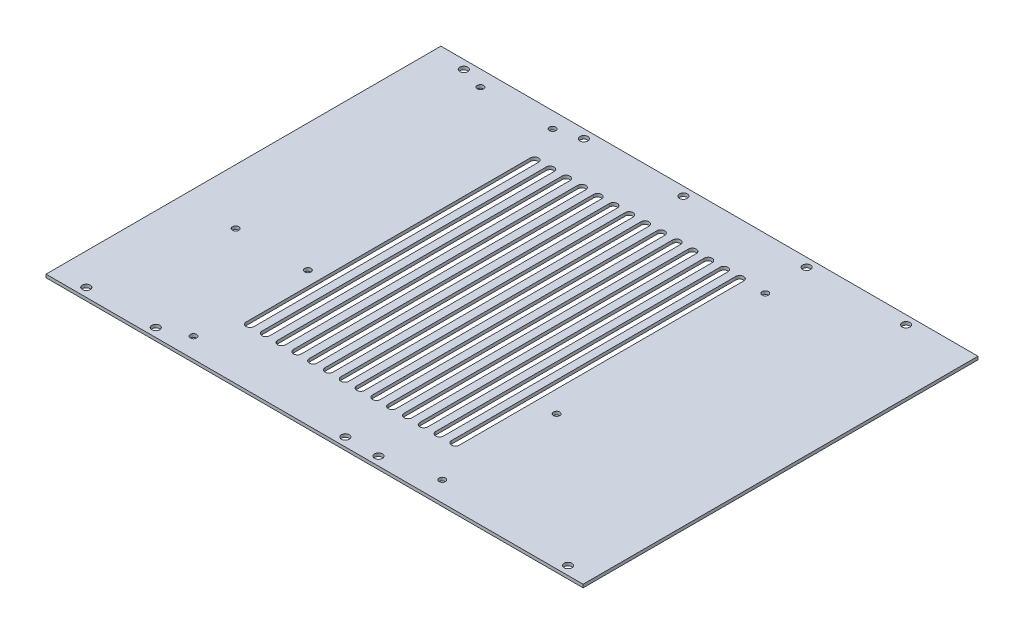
from build123d import *

# Parameters (mm, degrees)
SKETCH1_W           = 340
SKETCH1_H           = 250
SKETCH1_R           = 2
SKETCH1_R_2         = 2.5
BOSS_EXTRUDE1_DEPTH = 2


with BuildPart() as part:
    # Sketch1 → Boss-Extrude1 (new body)
    with BuildSketch(Plane(origin=(0, 0, 0), x_dir=(1, 0, 0), z_dir=(0, 1, 0))):
        Rectangle(SKETCH1_W, SKETCH1_H)
        with Locations(Location((-135, 115, 0), (0, 0, 270))):
            Circle(SKETCH1_R, mode=Mode.SUBTRACT)
        with Locations(Location((-89.28, 115, 0), (0, 0, 270))):
            Circle(SKETCH1_R, mode=Mode.SUBTRACT)
        with Locations(Location((68.2, 92.14, 0), (0, 0, 270))):
            Circle(SKETCH1_R, mode=Mode.SUBTRACT)
        with Locations(Location((-135, -39.94, 0), (0, 0, 270))):
            Circle(SKETCH1_R, mode=Mode.SUBTRACT)
        with Locations(Location((-89.28, -39.94, 0), (0, 0, 270))):
            Circle(SKETCH1_R, mode=Mode.SUBTRACT)
        with Locations(Location((68.2, -39.94, 0), (0, 0, 270))):
            Circle(SKETCH1_R, mode=Mode.SUBTRACT)
        with Locations(Location((-89.28, -112.33, 0), (0, 0, 270))):
            Circle(SKETCH1_R, mode=Mode.SUBTRACT)
        with Locations(Location((68.2, -112.33, 0), (0, 0, 270))):
            Circle(SKETCH1_R, mode=Mode.SUBTRACT)
        with Locations(Location((130, 119.5, 0), (0, 0, 270))):
            Circle(SKETCH1_R_2, mode=Mode.SUBTRACT)
        with Locations(Location((67, 119.5, 0), (0, 0, 270))):
            Circle(SKETCH1_R_2, mode=Mode.SUBTRACT)
        with Locations(Location((-11, 119.5, 0), (0, 0, 270))):
            Circle(SKETCH1_R_2, mode=Mode.SUBTRACT)
        with Locations(Location((-74, 119.5, 0), (0, 0, 270))):
            Circle(SKETCH1_R_2, mode=Mode.SUBTRACT)
        with Locations(Location((-106, -119.5, 0), (0, 0, 270))):
            Circle(SKETCH1_R_2, mode=Mode.SUBTRACT)
        with Locations(Location((14, -119.5, 0), (0, 0, 270))):
            Circle(SKETCH1_R_2, mode=Mode.SUBTRACT)
        with Locations(Location((35, -119.5, 0), (0, 0, 270))):
            Circle(SKETCH1_R_2, mode=Mode.SUBTRACT)
        with Locations(Location((155, -119.5, 0), (0, 0, 270))):
            Circle(SKETCH1_R_2, mode=Mode.SUBTRACT)
        with Locations(Location((-150, -119.5, 0), (0, 0, 270))):
            Circle(SKETCH1_R_2, mode=Mode.SUBTRACT)
        with Locations(Location((-150, 119.5, 0), (0, 0, 270))):
            Circle(SKETCH1_R_2, mode=Mode.SUBTRACT)
        with BuildLine():
            Line((-75.417136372, 92.093914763), (-75.417136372, -87.906085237))
            ThreePointArc((-75.417136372, -87.906085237), (-77.917136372, -90.406085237), (-80.417136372, -87.906085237))
            Line((-80.417136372, -87.906085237), (-80.417136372, 92.093914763))
            ThreePointArc((-80.417136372, 92.093914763), (-77.917136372, 94.593914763), (-75.417136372, 92.093914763))
        make_face(mode=Mode.SUBTRACT)
        with BuildLine():
            Line((-65.417136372, 92.093914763), (-65.417136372, -87.906085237))
            ThreePointArc((-65.417136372, -87.906085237), (-67.917136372, -90.406085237), (-70.417136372, -87.906085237))
            Line((-70.417136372, -87.906085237), (-70.417136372, 92.093914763))
            ThreePointArc((-70.417136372, 92.093914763), (-67.917136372, 94.593914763), (-65.417136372, 92.093914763))
        make_face(mode=Mode.SUBTRACT)
        with BuildLine():
            Line((-55.417136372, 92.093914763), (-55.417136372, -87.906085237))
            ThreePointArc((-55.417136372, -87.906085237), (-57.917136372, -90.406085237), (-60.417136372, -87.906085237))
            Line((-60.417136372, -87.906085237), (-60.417136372, 92.093914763))
            ThreePointArc((-60.417136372, 92.093914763), (-57.917136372, 94.593914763), (-55.417136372, 92.093914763))
        make_face(mode=Mode.SUBTRACT)
        with BuildLine():
            Line((-45.417136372, 92.093914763), (-45.417136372, -87.906085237))
            ThreePointArc((-45.417136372, -87.906085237), (-47.917136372, -90.406085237), (-50.417136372, -87.906085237))
            Line((-50.417136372, -87.906085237), (-50.417136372, 92.093914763))
            ThreePointArc((-50.417136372, 92.093914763), (-47.917136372, 94.593914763), (-45.417136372, 92.093914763))
        make_face(mode=Mode.SUBTRACT)
        with BuildLine():
            Line((-35.417136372, 92.093914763), (-35.417136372, -87.906085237))
            ThreePointArc((-35.417136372, -87.906085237), (-37.917136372, -90.406085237), (-40.417136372, -87.906085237))
            Line((-40.417136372, -87.906085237), (-40.417136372, 92.093914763))
            ThreePointArc((-40.417136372, 92.093914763), (-37.917136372, 94.593914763), (-35.417136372, 92.093914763))
        make_face(mode=Mode.SUBTRACT)
        with BuildLine():
            Line((-25.417136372, 92.093914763), (-25.417136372, -87.906085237))
            ThreePointArc((-25.417136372, -87.906085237), (-27.917136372, -90.406085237), (-30.417136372, -87.906085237))
            Line((-30.417136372, -87.906085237), (-30.417136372, 92.093914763))
            ThreePointArc((-30.417136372, 92.093914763), (-27.917136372, 94.593914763), (-25.417136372, 92.093914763))
        make_face(mode=Mode.SUBTRACT)
        with BuildLine():
            Line((-15.417136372, 92.093914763), (-15.417136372, -87.906085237))
            ThreePointArc((-15.417136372, -87.906085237), (-17.917136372, -90.406085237), (-20.417136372, -87.906085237))
            Line((-20.417136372, -87.906085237), (-20.417136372, 92.093914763))
            ThreePointArc((-20.417136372, 92.093914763), (-17.917136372, 94.593914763), (-15.417136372, 92.093914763))
        make_face(mode=Mode.SUBTRACT)
        with BuildLine():
            Line((-5.417136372, 92.093914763), (-5.417136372, -87.906085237))
            ThreePointArc((-5.417136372, -87.906085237), (-7.917136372, -90.406085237), (-10.417136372, -87.906085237))
            Line((-10.417136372, -87.906085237), (-10.417136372, 92.093914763))
            ThreePointArc((-10.417136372, 92.093914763), (-7.917136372, 94.593914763), (-5.417136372, 92.093914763))
        make_face(mode=Mode.SUBTRACT)
        with BuildLine():
            Line((4.582863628, 92.093914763), (4.582863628, -87.906085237))
            ThreePointArc((4.582863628, -87.906085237), (2.082863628, -90.406085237), (-0.417136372, -87.906085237))
            Line((-0.417136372, -87.906085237), (-0.417136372, 92.093914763))
            ThreePointArc((-0.417136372, 92.093914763), (2.082863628, 94.593914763), (4.582863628, 92.093914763))
        make_face(mode=Mode.SUBTRACT)
        with BuildLine():
            Line((14.582863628, 92.093914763), (14.582863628, -87.906085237))
            ThreePointArc((14.582863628, -87.906085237), (12.082863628, -90.406085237), (9.582863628, -87.906085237))
            Line((9.582863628, -87.906085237), (9.582863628, 92.093914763))
            ThreePointArc((9.582863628, 92.093914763), (12.082863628, 94.593914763), (14.582863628, 92.093914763))
        make_face(mode=Mode.SUBTRACT)
        with BuildLine():
            Line((24.582863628, 92.093914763), (24.582863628, -87.906085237))
            ThreePointArc((24.582863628, -87.906085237), (22.082863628, -90.406085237), (19.582863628, -87.906085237))
            Line((19.582863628, -87.906085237), (19.582863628, 92.093914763))
            ThreePointArc((19.582863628, 92.093914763), (22.082863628, 94.593914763), (24.582863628, 92.093914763))
        make_face(mode=Mode.SUBTRACT)
        with BuildLine():
            Line((34.582863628, 92.093914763), (34.582863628, -87.906085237))
            ThreePointArc((34.582863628, -87.906085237), (32.082863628, -90.406085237), (29.582863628, -87.906085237))
            Line((29.582863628, -87.906085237), (29.582863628, 92.093914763))
            ThreePointArc((29.582863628, 92.093914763), (32.082863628, 94.593914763), (34.582863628, 92.093914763))
        make_face(mode=Mode.SUBTRACT)
        with BuildLine():
            Line((44.582863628, 92.093914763), (44.582863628, -87.906085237))
            ThreePointArc((44.582863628, -87.906085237), (42.082863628, -90.406085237), (39.582863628, -87.906085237))
            Line((39.582863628, -87.906085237), (39.582863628, 92.093914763))
            ThreePointArc((39.582863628, 92.093914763), (42.082863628, 94.593914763), (44.582863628, 92.093914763))
        make_face(mode=Mode.SUBTRACT)
        with BuildLine():
            Line((54.582863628, 92.093914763), (54.582863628, -87.906085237))
            ThreePointArc((54.582863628, -87.906085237), (52.082863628, -90.406085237), (49.582863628, -87.906085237))
            Line((49.582863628, -87.906085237), (49.582863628, 92.093914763))
            ThreePointArc((49.582863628, 92.093914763), (52.082863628, 94.593914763), (54.582863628, 92.093914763))
        make_face(mode=Mode.SUBTRACT)
    extrude(amount=BOSS_EXTRUDE1_DEPTH)


solid = part.part
